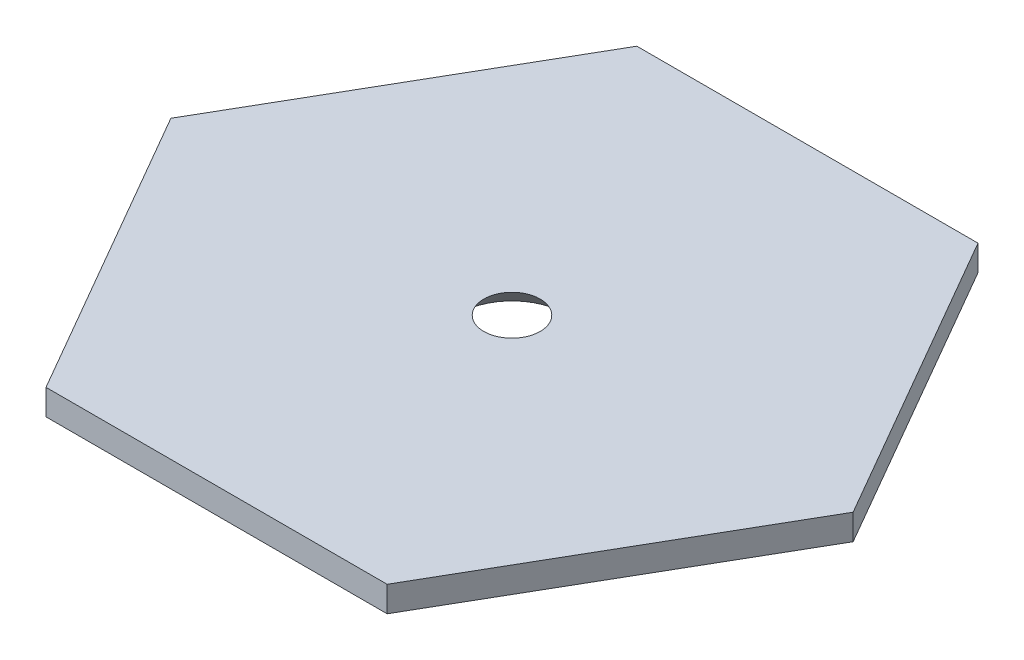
from build123d import *

# Parameters (mm, degrees)
EXTRUDE1_DEPTH = 3


with BuildPart() as part:
    # Sketch3 → Extrude1 (new body)
    with BuildSketch(Plane(origin=(0, 0, 0), x_dir=(1, 0, 0), z_dir=(0, 1, 0))):
        Polygon((40, 0), (20, 34.641016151), (-20, 34.641016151), (-40, 0), (-20, -34.641016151), (20, -34.641016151), align=None)
    extrude(amount=EXTRUDE1_DEPTH)

    # Sketch5 → CSK for M6 Countersunk Flat Head Screw2 (revolve, cut)
    with BuildSketch(Plane(origin=(0, 0, 0), x_dir=(0, 0, -1), z_dir=(1, 0, 0))):
        Polygon((0, 0), (0, 3), (3.2, 3), (3.2, 3.1), (6.3, 0), align=None)
    revolve(axis=Axis((0, -6.35, 0), (0, 1, 0)), mode=Mode.SUBTRACT)


solid = part.part
